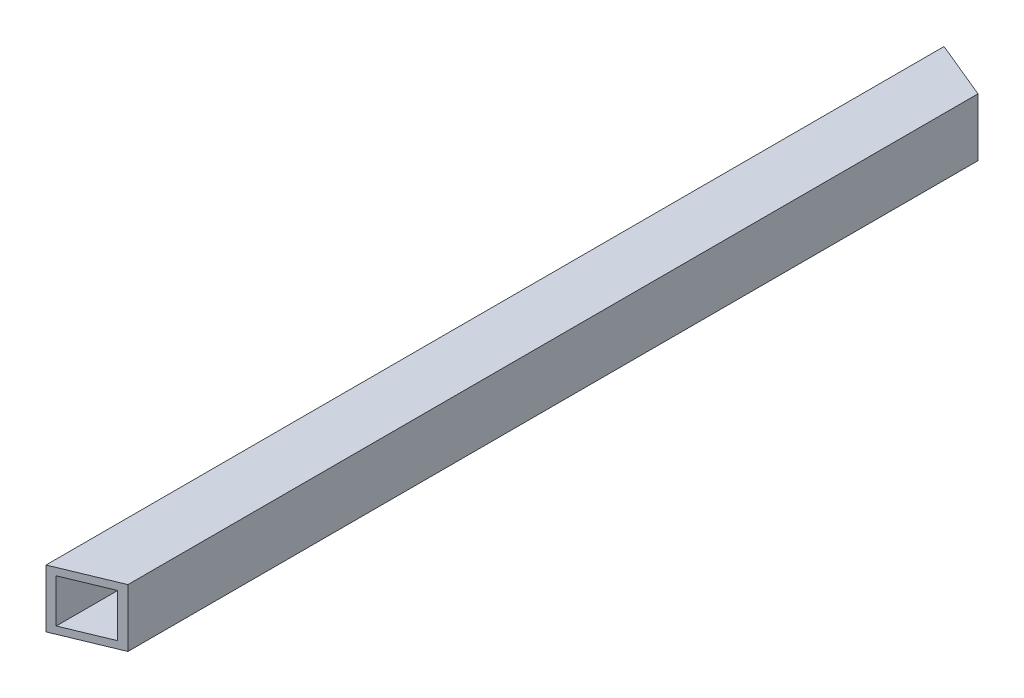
from build123d import *

# Parameters (mm, degrees)
SKETCH1_W           = 25.4
SKETCH1_H           = 25.4
SKETCH1_W_2         = 19.05
SKETCH1_H_2         = 19.05
BOSS_EXTRUDE1_DEPTH = 196.85
SKETCH2_OUTSIDE_W   = 106.468
SKETCH2_OUTSIDE_H   = 474.768
CUT_EXTRUDE1_DEPTH  = 199.887838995


with BuildPart() as part:
    # Sketch1 → Boss-Extrude1 (new, symmetric)
    with BuildSketch(Plane.XY):
        Rectangle(SKETCH1_W, SKETCH1_H)
        Rectangle(SKETCH1_W_2, SKETCH1_H_2, mode=Mode.SUBTRACT)
    extrude(amount=BOSS_EXTRUDE1_DEPTH, both=True)

    # Sketch2 outside → Cut-Extrude1 (cut, through all)
    with BuildSketch(Plane(origin=(0, 12.7, 0), x_dir=(1, 0, 0), z_dir=(0, 1, 0))):
        Rectangle(SKETCH2_OUTSIDE_W, SKETCH2_OUTSIDE_H)
        Polygon((12.7, 186.328975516), (-12.7, 196.85), (-12.7, -196.85), (12.7, -186.328975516), align=None, mode=Mode.SUBTRACT)
    extrude(amount=-CUT_EXTRUDE1_DEPTH, mode=Mode.SUBTRACT)


solid = part.part
